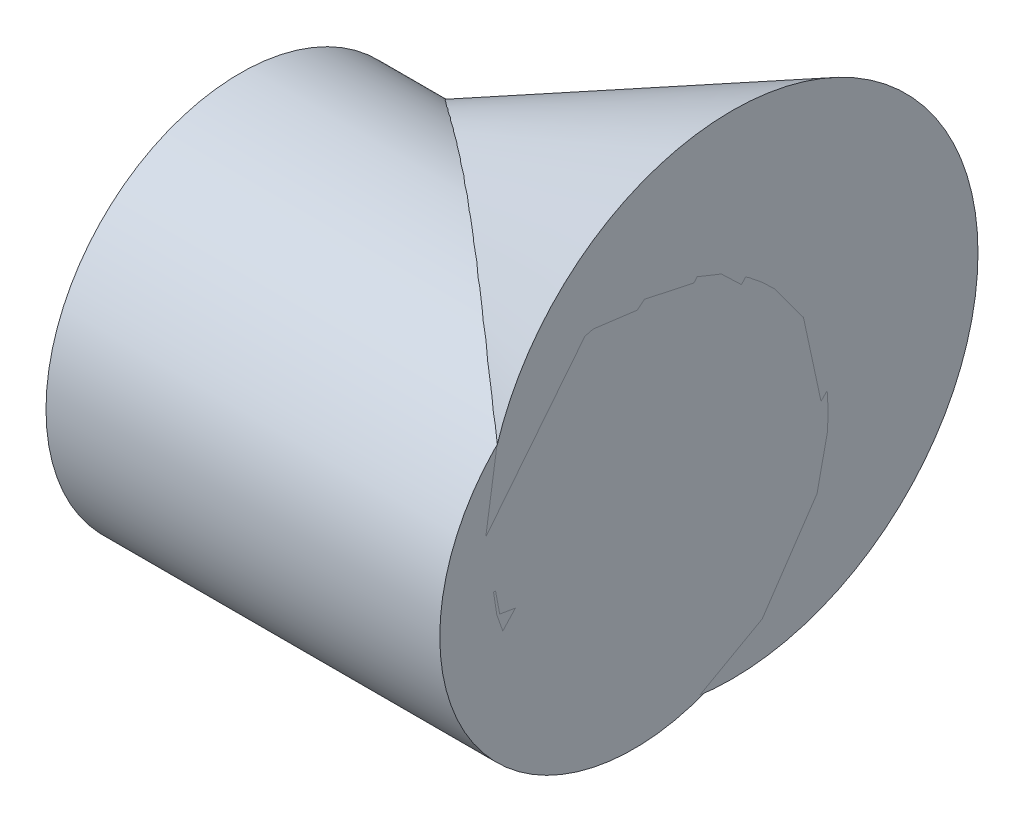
ISO-10303-21;
HEADER;
FILE_DESCRIPTION(('STEP AP214'),'2;1');
FILE_NAME('part.step','',(''),(''),'','','');
FILE_SCHEMA(('AUTOMOTIVE_DESIGN { 1 0 10303 214 1 1 1 1 }'));
ENDSEC;
DATA;
#1=APPLICATION_CONTEXT('core data for automotive mechanical design processes');
#2=APPLICATION_PROTOCOL_DEFINITION('international standard','automotive_design',2000,#1);
#3=PRODUCT_CONTEXT('',#1,'mechanical');
#4=PRODUCT('Part','Part','',(#3));
#5=PRODUCT_RELATED_PRODUCT_CATEGORY('part','',(#4));
#6=PRODUCT_DEFINITION_FORMATION('','',#4);
#7=PRODUCT_DEFINITION_CONTEXT('part definition',#1,'design');
#8=PRODUCT_DEFINITION('design','',#6,#7);
#9=PRODUCT_DEFINITION_SHAPE('','',#8);
#10=(LENGTH_UNIT() NAMED_UNIT(*) SI_UNIT(.MILLI.,.METRE.));
#11=(NAMED_UNIT(*) PLANE_ANGLE_UNIT() SI_UNIT($,.RADIAN.));
#12=(NAMED_UNIT(*) SI_UNIT($,.STERADIAN.) SOLID_ANGLE_UNIT());
#13=UNCERTAINTY_MEASURE_WITH_UNIT(LENGTH_MEASURE(1.E-05),#10,'distance_accuracy_value','');
#14=(GEOMETRIC_REPRESENTATION_CONTEXT(3) GLOBAL_UNCERTAINTY_ASSIGNED_CONTEXT((#13)) GLOBAL_UNIT_ASSIGNED_CONTEXT((#10,
#11,#12)) REPRESENTATION_CONTEXT('',''));
#15=CARTESIAN_POINT('',(0.,0.,0.));
#16=DIRECTION('',(0.,0.,1.));
#17=DIRECTION('',(1.,0.,0.));
#18=AXIS2_PLACEMENT_3D('',#15,#16,#17);
#19=CARTESIAN_POINT('',(-37.9985294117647,-6.43983083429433,9.94809688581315));
#20=DIRECTION('',(1.,0.,0.));
#21=DIRECTION('',(0.,0.,-1.));
#22=AXIS2_PLACEMENT_3D('',#19,#20,#21);
#23=CYLINDRICAL_SURFACE('',#22,19.7236424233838);
#24=CARTESIAN_POINT('',(-37.9985294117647,-6.43983083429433,9.94809688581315));
#25=DIRECTION('',(1.,0.,0.));
#26=DIRECTION('',(0.,0.,-1.));
#27=AXIS2_PLACEMENT_3D('',#24,#25,#26);
#28=CIRCLE('',#27,19.7236424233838);
#29=CARTESIAN_POINT('',(-37.9985294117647,-6.43983083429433,-9.77554553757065));
#30=VERTEX_POINT('',#29);
#31=EDGE_CURVE('E11',#30,#30,#28,.T.);
#32=ORIENTED_EDGE('',*,*,#31,.T.);
#33=EDGE_LOOP('',(#32));
#34=FACE_BOUND('',#33,.T.);
#35=CARTESIAN_POINT('',(2.0014705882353,-6.43983083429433,9.94809688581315));
#36=DIRECTION('',(1.,0.,0.));
#37=DIRECTION('',(0.,0.,-1.));
#38=AXIS2_PLACEMENT_3D('',#35,#36,#37);
#39=CIRCLE('',#38,19.7236424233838);
#40=CARTESIAN_POINT('',(2.0014705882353,-6.43983083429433,-9.77554553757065));
#41=VERTEX_POINT('',#40);
#42=EDGE_CURVE('E42',#41,#41,#39,.T.);
#43=ORIENTED_EDGE('',*,*,#42,.F.);
#44=EDGE_LOOP('',(#43));
#45=FACE_BOUND('',#44,.T.);
#46=ADVANCED_FACE('F39',(#34,#45),#23,.T.);
#47=CARTESIAN_POINT('',(-37.9985294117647,-6.43983083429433,9.94809688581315));
#48=DIRECTION('',(1.,0.,0.));
#49=DIRECTION('',(0.,0.,-1.));
#50=AXIS2_PLACEMENT_3D('',#47,#48,#49);
#51=PLANE('',#50);
#52=ORIENTED_EDGE('',*,*,#31,.F.);
#53=EDGE_LOOP('',(#52));
#54=FACE_BOUND('',#53,.T.);
#55=ADVANCED_FACE('F54',(#54),#51,.F.);
#56=CARTESIAN_POINT('',(2.0014705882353,-6.43983083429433,9.94809688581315));
#57=DIRECTION('',(1.,0.,0.));
#58=DIRECTION('',(0.,0.,-1.));
#59=AXIS2_PLACEMENT_3D('',#56,#57,#58);
#60=PLANE('',#59);
#61=ORIENTED_EDGE('',*,*,#42,.T.);
#62=EDGE_LOOP('',(#61));
#63=FACE_BOUND('',#62,.T.);
#64=ADVANCED_FACE('F51',(#63),#60,.T.);
#65=CLOSED_SHELL('',(#46,#55,#64));
#66=MANIFOLD_SOLID_BREP('B2',#65);
#67=CARTESIAN_POINT('',(2.0014705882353,0.,0.));
#68=DIRECTION('',(1.,0.,0.));
#69=DIRECTION('',(0.,0.,-1.));
#70=AXIS2_PLACEMENT_3D('',#67,#68,#69);
#71=CONICAL_SURFACE('',#70,25.,0.463647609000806);
#72=CARTESIAN_POINT('',(-47.9985294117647,0.,0.));
#73=VERTEX_POINT('',#72);
#74=VERTEX_LOOP('',#73);
#75=FACE_BOUND('',#74,.T.);
#76=CARTESIAN_POINT('',(2.0014705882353,0.,0.));
#77=DIRECTION('',(-1.,0.,0.));
#78=DIRECTION('',(0.,0.,1.));
#79=AXIS2_PLACEMENT_3D('',#76,#77,#78);
#80=CIRCLE('',#79,25.);
#81=CARTESIAN_POINT('',(2.0014705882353,0.,25.));
#82=VERTEX_POINT('',#81);
#83=EDGE_CURVE('E37',#82,#82,#80,.T.);
#84=ORIENTED_EDGE('',*,*,#83,.T.);
#85=EDGE_LOOP('',(#84));
#86=FACE_BOUND('',#85,.T.);
#87=ADVANCED_FACE('F80',(#75,#86),#71,.T.);
#88=CARTESIAN_POINT('',(2.0014705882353,25.,0.));
#89=DIRECTION('',(-1.,0.,0.));
#90=DIRECTION('',(0.,0.,1.));
#91=AXIS2_PLACEMENT_3D('',#88,#89,#90);
#92=PLANE('',#91);
#93=ORIENTED_EDGE('',*,*,#83,.F.);
#94=EDGE_LOOP('',(#93));
#95=FACE_BOUND('',#94,.T.);
#96=ADVANCED_FACE('F89',(#95),#92,.F.);
#97=CLOSED_SHELL('',(#87,#96));
#98=MANIFOLD_SOLID_BREP('B6',#97);
#99=ADVANCED_BREP_SHAPE_REPRESENTATION('',(#18,#66,#98),#14);
#100=SHAPE_DEFINITION_REPRESENTATION(#9,#99);
ENDSEC;
END-ISO-10303-21;
